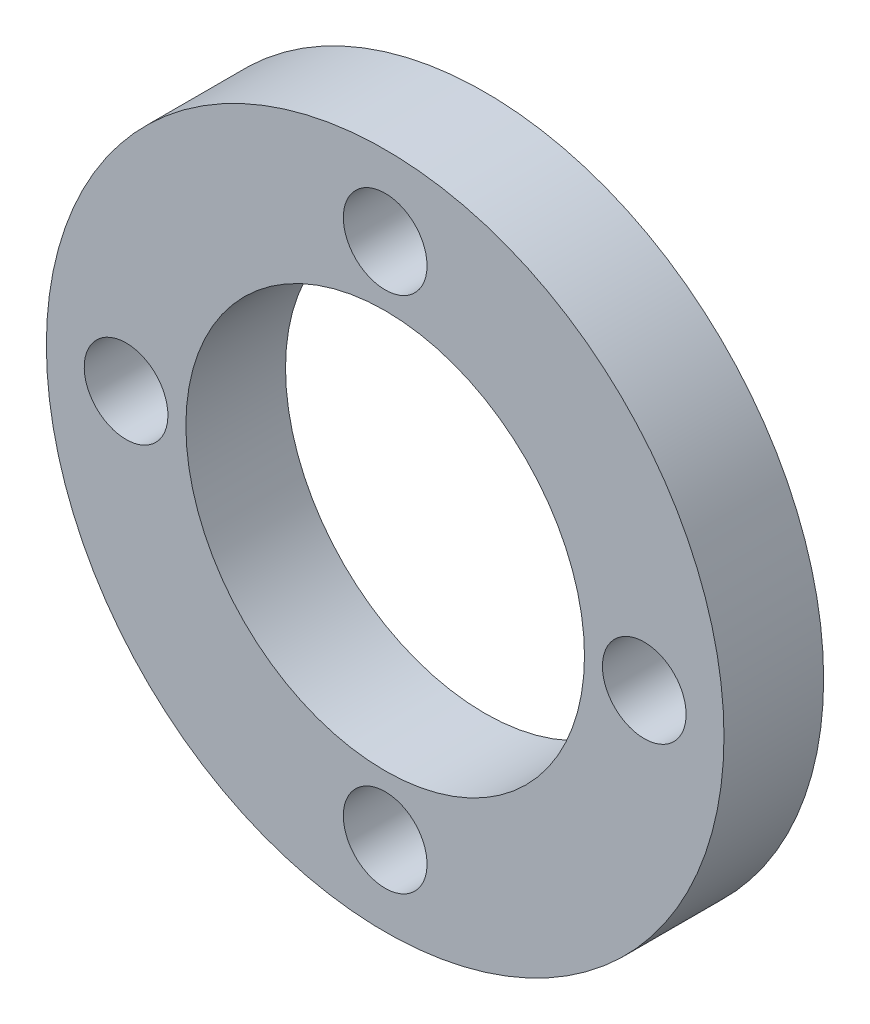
ISO-10303-21;
HEADER;
FILE_DESCRIPTION(('STEP AP214'),'2;1');
FILE_NAME('part.step','',(''),(''),'','','');
FILE_SCHEMA(('AUTOMOTIVE_DESIGN { 1 0 10303 214 1 1 1 1 }'));
ENDSEC;
DATA;
#1=APPLICATION_CONTEXT('core data for automotive mechanical design processes');
#2=APPLICATION_PROTOCOL_DEFINITION('international standard','automotive_design',2000,#1);
#3=PRODUCT_CONTEXT('',#1,'mechanical');
#4=PRODUCT('Part','Part','',(#3));
#5=PRODUCT_RELATED_PRODUCT_CATEGORY('part','',(#4));
#6=PRODUCT_DEFINITION_FORMATION('','',#4);
#7=PRODUCT_DEFINITION_CONTEXT('part definition',#1,'design');
#8=PRODUCT_DEFINITION('design','',#6,#7);
#9=PRODUCT_DEFINITION_SHAPE('','',#8);
#10=(LENGTH_UNIT() NAMED_UNIT(*) SI_UNIT(.MILLI.,.METRE.));
#11=(NAMED_UNIT(*) PLANE_ANGLE_UNIT() SI_UNIT($,.RADIAN.));
#12=(NAMED_UNIT(*) SI_UNIT($,.STERADIAN.) SOLID_ANGLE_UNIT());
#13=UNCERTAINTY_MEASURE_WITH_UNIT(LENGTH_MEASURE(1.E-05),#10,'distance_accuracy_value','');
#14=(GEOMETRIC_REPRESENTATION_CONTEXT(3) GLOBAL_UNCERTAINTY_ASSIGNED_CONTEXT((#13)) GLOBAL_UNIT_ASSIGNED_CONTEXT((#10,
#11,#12)) REPRESENTATION_CONTEXT('',''));
#15=CARTESIAN_POINT('',(0.,0.,0.));
#16=DIRECTION('',(0.,0.,1.));
#17=DIRECTION('',(1.,0.,0.));
#18=AXIS2_PLACEMENT_3D('',#15,#16,#17);
#19=CARTESIAN_POINT('',(0.,0.,5.));
#20=DIRECTION('',(0.,0.,1.));
#21=DIRECTION('',(1.,0.,0.));
#22=AXIS2_PLACEMENT_3D('',#19,#20,#21);
#23=PLANE('',#22);
#24=CARTESIAN_POINT('',(-13.,1.36167851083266E-13,5.));
#25=DIRECTION('',(0.,0.,1.));
#26=DIRECTION('',(0.,1.,0.));
#27=AXIS2_PLACEMENT_3D('',#24,#25,#26);
#28=CIRCLE('',#27,2.1);
#29=CARTESIAN_POINT('',(-13.,2.10000000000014,5.));
#30=VERTEX_POINT('',#29);
#31=EDGE_CURVE('E80',#30,#30,#28,.T.);
#32=ORIENTED_EDGE('',*,*,#31,.F.);
#33=EDGE_LOOP('',(#32));
#34=FACE_BOUND('',#33,.T.);
#35=CARTESIAN_POINT('',(0.,-13.,5.));
#36=DIRECTION('',(0.,0.,1.));
#37=DIRECTION('',(-1.,0.,0.));
#38=AXIS2_PLACEMENT_3D('',#35,#36,#37);
#39=CIRCLE('',#38,2.1);
#40=CARTESIAN_POINT('',(-2.10000000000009,-13.,5.));
#41=VERTEX_POINT('',#40);
#42=EDGE_CURVE('E74',#41,#41,#39,.T.);
#43=ORIENTED_EDGE('',*,*,#42,.F.);
#44=EDGE_LOOP('',(#43));
#45=FACE_BOUND('',#44,.T.);
#46=CARTESIAN_POINT('',(13.,0.,5.));
#47=DIRECTION('',(0.,0.,1.));
#48=DIRECTION('',(0.,-1.,0.));
#49=AXIS2_PLACEMENT_3D('',#46,#47,#48);
#50=CIRCLE('',#49,2.1);
#51=CARTESIAN_POINT('',(13.,-2.10000000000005,5.));
#52=VERTEX_POINT('',#51);
#53=EDGE_CURVE('E68',#52,#52,#50,.T.);
#54=ORIENTED_EDGE('',*,*,#53,.F.);
#55=EDGE_LOOP('',(#54));
#56=FACE_BOUND('',#55,.T.);
#57=CARTESIAN_POINT('',(0.,13.,5.));
#58=DIRECTION('',(0.,0.,1.));
#59=DIRECTION('',(1.,0.,0.));
#60=AXIS2_PLACEMENT_3D('',#57,#58,#59);
#61=CIRCLE('',#60,2.1);
#62=CARTESIAN_POINT('',(2.1,13.,5.));
#63=VERTEX_POINT('',#62);
#64=EDGE_CURVE('E62',#63,#63,#61,.T.);
#65=ORIENTED_EDGE('',*,*,#64,.F.);
#66=EDGE_LOOP('',(#65));
#67=FACE_BOUND('',#66,.T.);
#68=CARTESIAN_POINT('',(0.,0.,5.));
#69=DIRECTION('',(0.,0.,1.));
#70=DIRECTION('',(1.,0.,0.));
#71=AXIS2_PLACEMENT_3D('',#68,#69,#70);
#72=CIRCLE('',#71,17.);
#73=CARTESIAN_POINT('',(17.,0.,5.));
#74=VERTEX_POINT('',#73);
#75=EDGE_CURVE('E10',#74,#74,#72,.T.);
#76=ORIENTED_EDGE('',*,*,#75,.T.);
#77=EDGE_LOOP('',(#76));
#78=FACE_BOUND('',#77,.T.);
#79=CARTESIAN_POINT('',(0.,0.,5.));
#80=DIRECTION('',(0.,0.,1.));
#81=DIRECTION('',(1.,0.,0.));
#82=AXIS2_PLACEMENT_3D('',#79,#80,#81);
#83=CIRCLE('',#82,10.);
#84=CARTESIAN_POINT('',(10.,0.,5.));
#85=VERTEX_POINT('',#84);
#86=EDGE_CURVE('E48',#85,#85,#83,.T.);
#87=ORIENTED_EDGE('',*,*,#86,.F.);
#88=EDGE_LOOP('',(#87));
#89=FACE_BOUND('',#88,.T.);
#90=ADVANCED_FACE('F33',(#34,#45,#56,#67,#78,#89),#23,.T.);
#91=CARTESIAN_POINT('',(0.,0.,0.));
#92=DIRECTION('',(0.,0.,1.));
#93=DIRECTION('',(1.,0.,0.));
#94=AXIS2_PLACEMENT_3D('',#91,#92,#93);
#95=PLANE('',#94);
#96=CARTESIAN_POINT('',(-13.,1.36167851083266E-13,0.));
#97=DIRECTION('',(0.,0.,1.));
#98=DIRECTION('',(0.,1.,0.));
#99=AXIS2_PLACEMENT_3D('',#96,#97,#98);
#100=CIRCLE('',#99,2.1);
#101=CARTESIAN_POINT('',(-13.,2.10000000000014,0.));
#102=VERTEX_POINT('',#101);
#103=EDGE_CURVE('E77',#102,#102,#100,.T.);
#104=ORIENTED_EDGE('',*,*,#103,.T.);
#105=EDGE_LOOP('',(#104));
#106=FACE_BOUND('',#105,.T.);
#107=CARTESIAN_POINT('',(0.,-13.,0.));
#108=DIRECTION('',(0.,0.,1.));
#109=DIRECTION('',(-1.,0.,0.));
#110=AXIS2_PLACEMENT_3D('',#107,#108,#109);
#111=CIRCLE('',#110,2.1);
#112=CARTESIAN_POINT('',(-2.10000000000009,-13.,0.));
#113=VERTEX_POINT('',#112);
#114=EDGE_CURVE('E71',#113,#113,#111,.T.);
#115=ORIENTED_EDGE('',*,*,#114,.T.);
#116=EDGE_LOOP('',(#115));
#117=FACE_BOUND('',#116,.T.);
#118=CARTESIAN_POINT('',(13.,0.,0.));
#119=DIRECTION('',(0.,0.,1.));
#120=DIRECTION('',(0.,-1.,0.));
#121=AXIS2_PLACEMENT_3D('',#118,#119,#120);
#122=CIRCLE('',#121,2.1);
#123=CARTESIAN_POINT('',(13.,-2.10000000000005,0.));
#124=VERTEX_POINT('',#123);
#125=EDGE_CURVE('E65',#124,#124,#122,.T.);
#126=ORIENTED_EDGE('',*,*,#125,.T.);
#127=EDGE_LOOP('',(#126));
#128=FACE_BOUND('',#127,.T.);
#129=CARTESIAN_POINT('',(0.,13.,0.));
#130=DIRECTION('',(0.,0.,1.));
#131=DIRECTION('',(1.,0.,0.));
#132=AXIS2_PLACEMENT_3D('',#129,#130,#131);
#133=CIRCLE('',#132,2.1);
#134=CARTESIAN_POINT('',(2.1,13.,0.));
#135=VERTEX_POINT('',#134);
#136=EDGE_CURVE('E59',#135,#135,#133,.T.);
#137=ORIENTED_EDGE('',*,*,#136,.T.);
#138=EDGE_LOOP('',(#137));
#139=FACE_BOUND('',#138,.T.);
#140=CARTESIAN_POINT('',(0.,0.,0.));
#141=DIRECTION('',(0.,0.,1.));
#142=DIRECTION('',(1.,0.,0.));
#143=AXIS2_PLACEMENT_3D('',#140,#141,#142);
#144=CIRCLE('',#143,17.);
#145=CARTESIAN_POINT('',(17.,0.,0.));
#146=VERTEX_POINT('',#145);
#147=EDGE_CURVE('E41',#146,#146,#144,.T.);
#148=ORIENTED_EDGE('',*,*,#147,.F.);
#149=EDGE_LOOP('',(#148));
#150=FACE_BOUND('',#149,.T.);
#151=CARTESIAN_POINT('',(0.,0.,0.));
#152=DIRECTION('',(0.,0.,1.));
#153=DIRECTION('',(1.,0.,0.));
#154=AXIS2_PLACEMENT_3D('',#151,#152,#153);
#155=CIRCLE('',#154,10.);
#156=CARTESIAN_POINT('',(10.,0.,0.));
#157=VERTEX_POINT('',#156);
#158=EDGE_CURVE('E54',#157,#157,#155,.T.);
#159=ORIENTED_EDGE('',*,*,#158,.T.);
#160=EDGE_LOOP('',(#159));
#161=FACE_BOUND('',#160,.T.);
#162=ADVANCED_FACE('F88',(#106,#117,#128,#139,#150,#161),#95,.F.);
#163=CARTESIAN_POINT('',(0.,0.,5.));
#164=DIRECTION('',(0.,0.,-1.));
#165=DIRECTION('',(-1.,0.,0.));
#166=AXIS2_PLACEMENT_3D('',#163,#164,#165);
#167=CYLINDRICAL_SURFACE('',#166,17.);
#168=ORIENTED_EDGE('',*,*,#75,.F.);
#169=EDGE_LOOP('',(#168));
#170=FACE_BOUND('',#169,.T.);
#171=ORIENTED_EDGE('',*,*,#147,.T.);
#172=EDGE_LOOP('',(#171));
#173=FACE_BOUND('',#172,.T.);
#174=ADVANCED_FACE('F35',(#170,#173),#167,.T.);
#175=CARTESIAN_POINT('',(0.,0.,5.));
#176=DIRECTION('',(0.,0.,-1.));
#177=DIRECTION('',(-1.,0.,0.));
#178=AXIS2_PLACEMENT_3D('',#175,#176,#177);
#179=CYLINDRICAL_SURFACE('',#178,10.);
#180=ORIENTED_EDGE('',*,*,#86,.T.);
#181=EDGE_LOOP('',(#180));
#182=FACE_BOUND('',#181,.T.);
#183=ORIENTED_EDGE('',*,*,#158,.F.);
#184=EDGE_LOOP('',(#183));
#185=FACE_BOUND('',#184,.T.);
#186=ADVANCED_FACE('F97',(#182,#185),#179,.F.);
#187=CARTESIAN_POINT('',(0.,13.,0.));
#188=DIRECTION('',(0.,0.,1.));
#189=DIRECTION('',(1.,0.,0.));
#190=AXIS2_PLACEMENT_3D('',#187,#188,#189);
#191=CYLINDRICAL_SURFACE('',#190,2.1);
#192=ORIENTED_EDGE('',*,*,#136,.F.);
#193=EDGE_LOOP('',(#192));
#194=FACE_BOUND('',#193,.T.);
#195=ORIENTED_EDGE('',*,*,#64,.T.);
#196=EDGE_LOOP('',(#195));
#197=FACE_BOUND('',#196,.T.);
#198=ADVANCED_FACE('F100',(#194,#197),#191,.F.);
#199=CARTESIAN_POINT('',(13.,0.,0.));
#200=DIRECTION('',(0.,0.,1.));
#201=DIRECTION('',(1.,0.,0.));
#202=AXIS2_PLACEMENT_3D('',#199,#200,#201);
#203=CYLINDRICAL_SURFACE('',#202,2.1);
#204=ORIENTED_EDGE('',*,*,#125,.F.);
#205=EDGE_LOOP('',(#204));
#206=FACE_BOUND('',#205,.T.);
#207=ORIENTED_EDGE('',*,*,#53,.T.);
#208=EDGE_LOOP('',(#207));
#209=FACE_BOUND('',#208,.T.);
#210=ADVANCED_FACE('F114',(#206,#209),#203,.F.);
#211=CARTESIAN_POINT('',(0.,-13.,0.));
#212=DIRECTION('',(0.,0.,1.));
#213=DIRECTION('',(1.,0.,0.));
#214=AXIS2_PLACEMENT_3D('',#211,#212,#213);
#215=CYLINDRICAL_SURFACE('',#214,2.1);
#216=ORIENTED_EDGE('',*,*,#114,.F.);
#217=EDGE_LOOP('',(#216));
#218=FACE_BOUND('',#217,.T.);
#219=ORIENTED_EDGE('',*,*,#42,.T.);
#220=EDGE_LOOP('',(#219));
#221=FACE_BOUND('',#220,.T.);
#222=ADVANCED_FACE('F118',(#218,#221),#215,.F.);
#223=CARTESIAN_POINT('',(-13.,1.36167851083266E-13,0.));
#224=DIRECTION('',(0.,0.,1.));
#225=DIRECTION('',(1.,0.,0.));
#226=AXIS2_PLACEMENT_3D('',#223,#224,#225);
#227=CYLINDRICAL_SURFACE('',#226,2.1);
#228=ORIENTED_EDGE('',*,*,#103,.F.);
#229=EDGE_LOOP('',(#228));
#230=FACE_BOUND('',#229,.T.);
#231=ORIENTED_EDGE('',*,*,#31,.T.);
#232=EDGE_LOOP('',(#231));
#233=FACE_BOUND('',#232,.T.);
#234=ADVANCED_FACE('F84',(#230,#233),#227,.F.);
#235=CLOSED_SHELL('',(#90,#162,#174,#186,#198,#210,#222,#234));
#236=MANIFOLD_SOLID_BREP('B2',#235);
#237=ADVANCED_BREP_SHAPE_REPRESENTATION('',(#18,#236),#14);
#238=SHAPE_DEFINITION_REPRESENTATION(#9,#237);
ENDSEC;
END-ISO-10303-21;
